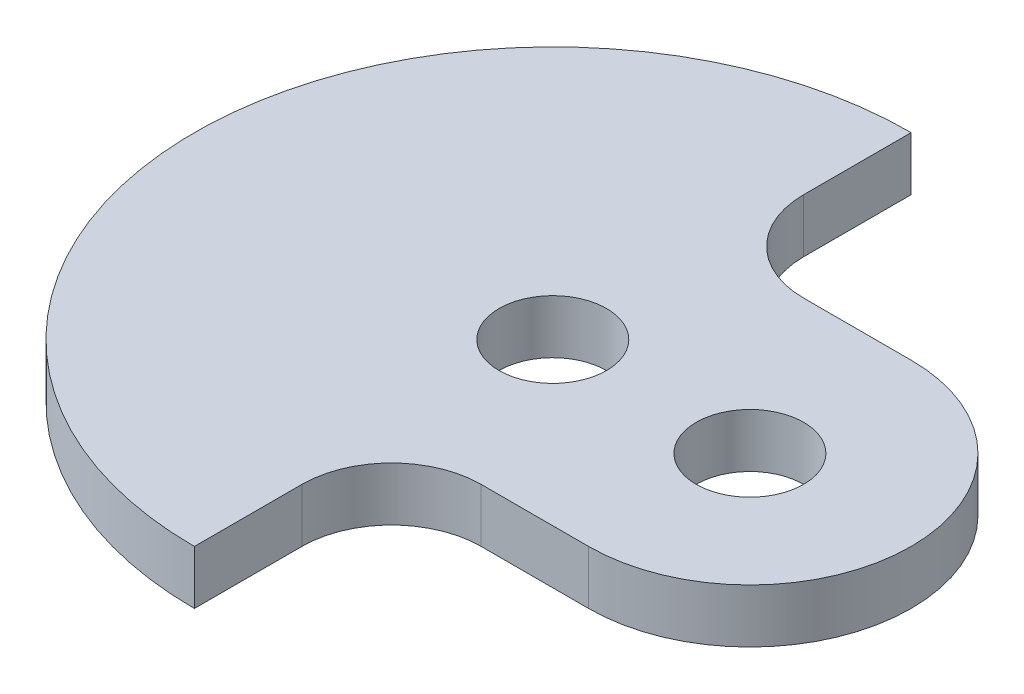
ISO-10303-21;
HEADER;
FILE_DESCRIPTION(('STEP AP214'),'2;1');
FILE_NAME('part.step','',(''),(''),'','','');
FILE_SCHEMA(('AUTOMOTIVE_DESIGN { 1 0 10303 214 1 1 1 1 }'));
ENDSEC;
DATA;
#1=APPLICATION_CONTEXT('core data for automotive mechanical design processes');
#2=APPLICATION_PROTOCOL_DEFINITION('international standard','automotive_design',2000,#1);
#3=PRODUCT_CONTEXT('',#1,'mechanical');
#4=PRODUCT('Part','Part','',(#3));
#5=PRODUCT_RELATED_PRODUCT_CATEGORY('part','',(#4));
#6=PRODUCT_DEFINITION_FORMATION('','',#4);
#7=PRODUCT_DEFINITION_CONTEXT('part definition',#1,'design');
#8=PRODUCT_DEFINITION('design','',#6,#7);
#9=PRODUCT_DEFINITION_SHAPE('','',#8);
#10=(LENGTH_UNIT() NAMED_UNIT(*) SI_UNIT(.MILLI.,.METRE.));
#11=(NAMED_UNIT(*) PLANE_ANGLE_UNIT() SI_UNIT($,.RADIAN.));
#12=(NAMED_UNIT(*) SI_UNIT($,.STERADIAN.) SOLID_ANGLE_UNIT());
#13=UNCERTAINTY_MEASURE_WITH_UNIT(LENGTH_MEASURE(1.E-05),#10,'distance_accuracy_value','');
#14=(GEOMETRIC_REPRESENTATION_CONTEXT(3) GLOBAL_UNCERTAINTY_ASSIGNED_CONTEXT((#13)) GLOBAL_UNIT_ASSIGNED_CONTEXT((#10,
#11,#12)) REPRESENTATION_CONTEXT('',''));
#15=CARTESIAN_POINT('',(0.,0.,0.));
#16=DIRECTION('',(0.,0.,1.));
#17=DIRECTION('',(1.,0.,0.));
#18=AXIS2_PLACEMENT_3D('',#15,#16,#17);
#19=CARTESIAN_POINT('',(45.6667674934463,3.,0.));
#20=DIRECTION('',(0.,1.,0.));
#21=DIRECTION('',(0.,0.,1.));
#22=AXIS2_PLACEMENT_3D('',#19,#20,#21);
#23=PLANE('',#22);
#24=CARTESIAN_POINT('',(34.6667674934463,3.,0.));
#25=DIRECTION('',(0.,1.,0.));
#26=DIRECTION('',(0.,0.,1.));
#27=AXIS2_PLACEMENT_3D('',#24,#25,#26);
#28=CIRCLE('',#27,3.);
#29=CARTESIAN_POINT('',(34.6667674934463,3.,3.));
#30=VERTEX_POINT('',#29);
#31=EDGE_CURVE('E116',#30,#30,#28,.T.);
#32=ORIENTED_EDGE('',*,*,#31,.F.);
#33=EDGE_LOOP('',(#32));
#34=FACE_BOUND('',#33,.T.);
#35=CARTESIAN_POINT('',(45.6667674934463,3.,0.));
#36=DIRECTION('',(0.,1.,0.));
#37=DIRECTION('',(0.,0.,1.));
#38=AXIS2_PLACEMENT_3D('',#35,#36,#37);
#39=CIRCLE('',#38,9.);
#40=CARTESIAN_POINT('',(45.6667674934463,3.,9.));
#41=VERTEX_POINT('',#40);
#42=CARTESIAN_POINT('',(45.6667674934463,3.,-9.));
#43=VERTEX_POINT('',#42);
#44=EDGE_CURVE('E134',#41,#43,#39,.T.);
#45=ORIENTED_EDGE('',*,*,#44,.T.);
#46=DIRECTION('',(-1.,0.,0.));
#47=VECTOR('',#46,1.);
#48=CARTESIAN_POINT('',(39.6667674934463,3.,-9.));
#49=LINE('',#48,#47);
#50=CARTESIAN_POINT('',(39.6667674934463,3.,-9.));
#51=VERTEX_POINT('',#50);
#52=EDGE_CURVE('E111',#43,#51,#49,.T.);
#53=ORIENTED_EDGE('',*,*,#52,.T.);
#54=CARTESIAN_POINT('',(39.6667674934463,3.,-14.));
#55=DIRECTION('',(0.,-1.,0.));
#56=DIRECTION('',(0.,0.,-1.));
#57=AXIS2_PLACEMENT_3D('',#54,#55,#56);
#58=CIRCLE('',#57,5.);
#59=CARTESIAN_POINT('',(34.6667674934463,3.,-14.));
#60=VERTEX_POINT('',#59);
#61=EDGE_CURVE('E137',#51,#60,#58,.T.);
#62=ORIENTED_EDGE('',*,*,#61,.T.);
#63=DIRECTION('',(0.,0.,-1.));
#64=VECTOR('',#63,1.);
#65=CARTESIAN_POINT('',(34.6667674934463,3.,-14.));
#66=LINE('',#65,#64);
#67=CARTESIAN_POINT('',(34.6667674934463,3.,-20.));
#68=VERTEX_POINT('',#67);
#69=EDGE_CURVE('E139',#60,#68,#66,.T.);
#70=ORIENTED_EDGE('',*,*,#69,.T.);
#71=CARTESIAN_POINT('',(34.6667674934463,3.,0.));
#72=DIRECTION('',(0.,1.,0.));
#73=DIRECTION('',(0.,0.,1.));
#74=AXIS2_PLACEMENT_3D('',#71,#72,#73);
#75=CIRCLE('',#74,20.);
#76=CARTESIAN_POINT('',(34.6667674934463,3.,20.));
#77=VERTEX_POINT('',#76);
#78=EDGE_CURVE('E141',#68,#77,#75,.T.);
#79=ORIENTED_EDGE('',*,*,#78,.T.);
#80=DIRECTION('',(0.,0.,-1.));
#81=VECTOR('',#80,1.);
#82=CARTESIAN_POINT('',(34.6667674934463,3.,20.));
#83=LINE('',#82,#81);
#84=CARTESIAN_POINT('',(34.6667674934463,3.,14.));
#85=VERTEX_POINT('',#84);
#86=EDGE_CURVE('E143',#77,#85,#83,.T.);
#87=ORIENTED_EDGE('',*,*,#86,.T.);
#88=CARTESIAN_POINT('',(39.6667674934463,3.,14.));
#89=DIRECTION('',(0.,-1.,0.));
#90=DIRECTION('',(0.,0.,-1.));
#91=AXIS2_PLACEMENT_3D('',#88,#89,#90);
#92=CIRCLE('',#91,5.);
#93=CARTESIAN_POINT('',(39.6667674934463,3.,9.));
#94=VERTEX_POINT('',#93);
#95=EDGE_CURVE('E52',#85,#94,#92,.T.);
#96=ORIENTED_EDGE('',*,*,#95,.T.);
#97=DIRECTION('',(1.,0.,0.));
#98=VECTOR('',#97,1.);
#99=CARTESIAN_POINT('',(39.6667674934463,3.,9.));
#100=LINE('',#99,#98);
#101=EDGE_CURVE('E47',#94,#41,#100,.T.);
#102=ORIENTED_EDGE('',*,*,#101,.T.);
#103=EDGE_LOOP('',(#45,#53,#62,#70,#79,#87,#96,#102));
#104=FACE_BOUND('',#103,.T.);
#105=CARTESIAN_POINT('',(45.6667674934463,3.,0.));
#106=DIRECTION('',(0.,1.,0.));
#107=DIRECTION('',(0.,0.,1.));
#108=AXIS2_PLACEMENT_3D('',#105,#106,#107);
#109=CIRCLE('',#108,3.);
#110=CARTESIAN_POINT('',(45.6667674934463,3.,3.));
#111=VERTEX_POINT('',#110);
#112=EDGE_CURVE('E214',#111,#111,#109,.T.);
#113=ORIENTED_EDGE('',*,*,#112,.F.);
#114=EDGE_LOOP('',(#113));
#115=FACE_BOUND('',#114,.T.);
#116=ADVANCED_FACE('F32',(#34,#104,#115),#23,.T.);
#117=CARTESIAN_POINT('',(45.6667674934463,0.,0.));
#118=DIRECTION('',(0.,1.,0.));
#119=DIRECTION('',(0.,0.,1.));
#120=AXIS2_PLACEMENT_3D('',#117,#118,#119);
#121=PLANE('',#120);
#122=CARTESIAN_POINT('',(34.6667674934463,0.,0.));
#123=DIRECTION('',(0.,1.,0.));
#124=DIRECTION('',(0.,0.,1.));
#125=AXIS2_PLACEMENT_3D('',#122,#123,#124);
#126=CIRCLE('',#125,3.);
#127=CARTESIAN_POINT('',(34.6667674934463,0.,3.));
#128=VERTEX_POINT('',#127);
#129=EDGE_CURVE('E119',#128,#128,#126,.T.);
#130=ORIENTED_EDGE('',*,*,#129,.T.);
#131=EDGE_LOOP('',(#130));
#132=FACE_BOUND('',#131,.T.);
#133=CARTESIAN_POINT('',(45.6667674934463,0.,0.));
#134=DIRECTION('',(0.,1.,0.));
#135=DIRECTION('',(0.,0.,1.));
#136=AXIS2_PLACEMENT_3D('',#133,#134,#135);
#137=CIRCLE('',#136,9.);
#138=CARTESIAN_POINT('',(45.6667674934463,0.,9.));
#139=VERTEX_POINT('',#138);
#140=CARTESIAN_POINT('',(45.6667674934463,0.,-9.));
#141=VERTEX_POINT('',#140);
#142=EDGE_CURVE('E102',#139,#141,#137,.T.);
#143=ORIENTED_EDGE('',*,*,#142,.F.);
#144=DIRECTION('',(1.,0.,0.));
#145=VECTOR('',#144,1.);
#146=CARTESIAN_POINT('',(39.6667674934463,0.,9.));
#147=LINE('',#146,#145);
#148=CARTESIAN_POINT('',(39.6667674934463,0.,9.));
#149=VERTEX_POINT('',#148);
#150=EDGE_CURVE('E132',#149,#139,#147,.T.);
#151=ORIENTED_EDGE('',*,*,#150,.F.);
#152=CARTESIAN_POINT('',(39.6667674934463,0.,14.));
#153=DIRECTION('',(0.,-1.,0.));
#154=DIRECTION('',(0.,0.,-1.));
#155=AXIS2_PLACEMENT_3D('',#152,#153,#154);
#156=CIRCLE('',#155,5.);
#157=CARTESIAN_POINT('',(34.6667674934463,0.,14.));
#158=VERTEX_POINT('',#157);
#159=EDGE_CURVE('E130',#158,#149,#156,.T.);
#160=ORIENTED_EDGE('',*,*,#159,.F.);
#161=DIRECTION('',(0.,0.,-1.));
#162=VECTOR('',#161,1.);
#163=CARTESIAN_POINT('',(34.6667674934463,0.,20.));
#164=LINE('',#163,#162);
#165=CARTESIAN_POINT('',(34.6667674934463,0.,20.));
#166=VERTEX_POINT('',#165);
#167=EDGE_CURVE('E128',#166,#158,#164,.T.);
#168=ORIENTED_EDGE('',*,*,#167,.F.);
#169=CARTESIAN_POINT('',(34.6667674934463,0.,0.));
#170=DIRECTION('',(0.,1.,0.));
#171=DIRECTION('',(0.,0.,1.));
#172=AXIS2_PLACEMENT_3D('',#169,#170,#171);
#173=CIRCLE('',#172,20.);
#174=CARTESIAN_POINT('',(34.6667674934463,0.,-20.));
#175=VERTEX_POINT('',#174);
#176=EDGE_CURVE('E126',#175,#166,#173,.T.);
#177=ORIENTED_EDGE('',*,*,#176,.F.);
#178=DIRECTION('',(0.,0.,-1.));
#179=VECTOR('',#178,1.);
#180=CARTESIAN_POINT('',(34.6667674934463,0.,-14.));
#181=LINE('',#180,#179);
#182=CARTESIAN_POINT('',(34.6667674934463,0.,-14.));
#183=VERTEX_POINT('',#182);
#184=EDGE_CURVE('E124',#183,#175,#181,.T.);
#185=ORIENTED_EDGE('',*,*,#184,.F.);
#186=CARTESIAN_POINT('',(39.6667674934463,0.,-14.));
#187=DIRECTION('',(0.,-1.,0.));
#188=DIRECTION('',(0.,0.,-1.));
#189=AXIS2_PLACEMENT_3D('',#186,#187,#188);
#190=CIRCLE('',#189,5.);
#191=CARTESIAN_POINT('',(39.6667674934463,0.,-9.));
#192=VERTEX_POINT('',#191);
#193=EDGE_CURVE('E104',#192,#183,#190,.T.);
#194=ORIENTED_EDGE('',*,*,#193,.F.);
#195=DIRECTION('',(-1.,0.,0.));
#196=VECTOR('',#195,1.);
#197=CARTESIAN_POINT('',(39.6667674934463,0.,-9.));
#198=LINE('',#197,#196);
#199=EDGE_CURVE('E97',#141,#192,#198,.T.);
#200=ORIENTED_EDGE('',*,*,#199,.F.);
#201=EDGE_LOOP('',(#143,#151,#160,#168,#177,#185,#194,#200));
#202=FACE_BOUND('',#201,.T.);
#203=CARTESIAN_POINT('',(45.6667674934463,0.,0.));
#204=DIRECTION('',(0.,1.,0.));
#205=DIRECTION('',(0.,0.,1.));
#206=AXIS2_PLACEMENT_3D('',#203,#204,#205);
#207=CIRCLE('',#206,3.);
#208=CARTESIAN_POINT('',(45.6667674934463,0.,3.));
#209=VERTEX_POINT('',#208);
#210=EDGE_CURVE('E217',#209,#209,#207,.T.);
#211=ORIENTED_EDGE('',*,*,#210,.T.);
#212=EDGE_LOOP('',(#211));
#213=FACE_BOUND('',#212,.T.);
#214=ADVANCED_FACE('F98',(#132,#202,#213),#121,.F.);
#215=CARTESIAN_POINT('',(45.6667674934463,3.,0.));
#216=DIRECTION('',(0.,-1.,0.));
#217=DIRECTION('',(0.,0.,-1.));
#218=AXIS2_PLACEMENT_3D('',#215,#216,#217);
#219=CYLINDRICAL_SURFACE('',#218,9.);
#220=ORIENTED_EDGE('',*,*,#142,.T.);
#221=DIRECTION('',(0.,-1.,0.));
#222=VECTOR('',#221,1.);
#223=CARTESIAN_POINT('',(45.6667674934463,3.,-9.));
#224=LINE('',#223,#222);
#225=EDGE_CURVE('E11',#43,#141,#224,.T.);
#226=ORIENTED_EDGE('',*,*,#225,.F.);
#227=ORIENTED_EDGE('',*,*,#44,.F.);
#228=DIRECTION('',(0.,-1.,0.));
#229=VECTOR('',#228,1.);
#230=CARTESIAN_POINT('',(45.6667674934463,3.,9.));
#231=LINE('',#230,#229);
#232=EDGE_CURVE('E115',#41,#139,#231,.T.);
#233=ORIENTED_EDGE('',*,*,#232,.T.);
#234=EDGE_LOOP('',(#220,#226,#227,#233));
#235=FACE_BOUND('',#234,.T.);
#236=ADVANCED_FACE('F34',(#235),#219,.T.);
#237=CARTESIAN_POINT('',(39.6667674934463,3.,-9.));
#238=DIRECTION('',(0.,0.,1.));
#239=DIRECTION('',(1.,0.,0.));
#240=AXIS2_PLACEMENT_3D('',#237,#238,#239);
#241=PLANE('',#240);
#242=ORIENTED_EDGE('',*,*,#199,.T.);
#243=DIRECTION('',(0.,-1.,0.));
#244=VECTOR('',#243,1.);
#245=CARTESIAN_POINT('',(39.6667674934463,3.,-9.));
#246=LINE('',#245,#244);
#247=EDGE_CURVE('E40',#51,#192,#246,.T.);
#248=ORIENTED_EDGE('',*,*,#247,.F.);
#249=ORIENTED_EDGE('',*,*,#52,.F.);
#250=ORIENTED_EDGE('',*,*,#225,.T.);
#251=EDGE_LOOP('',(#242,#248,#249,#250));
#252=FACE_BOUND('',#251,.T.);
#253=ADVANCED_FACE('F110',(#252),#241,.F.);
#254=CARTESIAN_POINT('',(39.6667674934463,3.,-14.));
#255=DIRECTION('',(0.,-1.,0.));
#256=DIRECTION('',(0.,0.,-1.));
#257=AXIS2_PLACEMENT_3D('',#254,#255,#256);
#258=CYLINDRICAL_SURFACE('',#257,5.);
#259=ORIENTED_EDGE('',*,*,#193,.T.);
#260=DIRECTION('',(0.,-1.,0.));
#261=VECTOR('',#260,1.);
#262=CARTESIAN_POINT('',(34.6667674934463,3.,-14.));
#263=LINE('',#262,#261);
#264=EDGE_CURVE('E160',#60,#183,#263,.T.);
#265=ORIENTED_EDGE('',*,*,#264,.F.);
#266=ORIENTED_EDGE('',*,*,#61,.F.);
#267=ORIENTED_EDGE('',*,*,#247,.T.);
#268=EDGE_LOOP('',(#259,#265,#266,#267));
#269=FACE_BOUND('',#268,.T.);
#270=ADVANCED_FACE('F164',(#269),#258,.F.);
#271=CARTESIAN_POINT('',(34.6667674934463,3.,-14.));
#272=DIRECTION('',(-1.,0.,0.));
#273=DIRECTION('',(0.,0.,1.));
#274=AXIS2_PLACEMENT_3D('',#271,#272,#273);
#275=PLANE('',#274);
#276=ORIENTED_EDGE('',*,*,#184,.T.);
#277=DIRECTION('',(0.,-1.,0.));
#278=VECTOR('',#277,1.);
#279=CARTESIAN_POINT('',(34.6667674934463,3.,-20.));
#280=LINE('',#279,#278);
#281=EDGE_CURVE('E157',#68,#175,#280,.T.);
#282=ORIENTED_EDGE('',*,*,#281,.F.);
#283=ORIENTED_EDGE('',*,*,#69,.F.);
#284=ORIENTED_EDGE('',*,*,#264,.T.);
#285=EDGE_LOOP('',(#276,#282,#283,#284));
#286=FACE_BOUND('',#285,.T.);
#287=ADVANCED_FACE('F172',(#286),#275,.F.);
#288=CARTESIAN_POINT('',(34.6667674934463,3.,0.));
#289=DIRECTION('',(0.,-1.,0.));
#290=DIRECTION('',(0.,0.,-1.));
#291=AXIS2_PLACEMENT_3D('',#288,#289,#290);
#292=CYLINDRICAL_SURFACE('',#291,20.);
#293=ORIENTED_EDGE('',*,*,#176,.T.);
#294=DIRECTION('',(0.,-1.,0.));
#295=VECTOR('',#294,1.);
#296=CARTESIAN_POINT('',(34.6667674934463,3.,20.));
#297=LINE('',#296,#295);
#298=EDGE_CURVE('E154',#77,#166,#297,.T.);
#299=ORIENTED_EDGE('',*,*,#298,.F.);
#300=ORIENTED_EDGE('',*,*,#78,.F.);
#301=ORIENTED_EDGE('',*,*,#281,.T.);
#302=EDGE_LOOP('',(#293,#299,#300,#301));
#303=FACE_BOUND('',#302,.T.);
#304=ADVANCED_FACE('F175',(#303),#292,.T.);
#305=CARTESIAN_POINT('',(34.6667674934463,3.,20.));
#306=DIRECTION('',(-1.,0.,0.));
#307=DIRECTION('',(0.,0.,1.));
#308=AXIS2_PLACEMENT_3D('',#305,#306,#307);
#309=PLANE('',#308);
#310=ORIENTED_EDGE('',*,*,#167,.T.);
#311=DIRECTION('',(0.,-1.,0.));
#312=VECTOR('',#311,1.);
#313=CARTESIAN_POINT('',(34.6667674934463,3.,14.));
#314=LINE('',#313,#312);
#315=EDGE_CURVE('E151',#85,#158,#314,.T.);
#316=ORIENTED_EDGE('',*,*,#315,.F.);
#317=ORIENTED_EDGE('',*,*,#86,.F.);
#318=ORIENTED_EDGE('',*,*,#298,.T.);
#319=EDGE_LOOP('',(#310,#316,#317,#318));
#320=FACE_BOUND('',#319,.T.);
#321=ADVANCED_FACE('F180',(#320),#309,.F.);
#322=CARTESIAN_POINT('',(39.6667674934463,3.,14.));
#323=DIRECTION('',(0.,-1.,0.));
#324=DIRECTION('',(0.,0.,-1.));
#325=AXIS2_PLACEMENT_3D('',#322,#323,#324);
#326=CYLINDRICAL_SURFACE('',#325,5.);
#327=ORIENTED_EDGE('',*,*,#159,.T.);
#328=DIRECTION('',(0.,-1.,0.));
#329=VECTOR('',#328,1.);
#330=CARTESIAN_POINT('',(39.6667674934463,3.,9.));
#331=LINE('',#330,#329);
#332=EDGE_CURVE('E148',#94,#149,#331,.T.);
#333=ORIENTED_EDGE('',*,*,#332,.F.);
#334=ORIENTED_EDGE('',*,*,#95,.F.);
#335=ORIENTED_EDGE('',*,*,#315,.T.);
#336=EDGE_LOOP('',(#327,#333,#334,#335));
#337=FACE_BOUND('',#336,.T.);
#338=ADVANCED_FACE('F183',(#337),#326,.F.);
#339=CARTESIAN_POINT('',(39.6667674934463,3.,9.));
#340=DIRECTION('',(0.,0.,-1.));
#341=DIRECTION('',(-1.,0.,0.));
#342=AXIS2_PLACEMENT_3D('',#339,#340,#341);
#343=PLANE('',#342);
#344=ORIENTED_EDGE('',*,*,#150,.T.);
#345=ORIENTED_EDGE('',*,*,#232,.F.);
#346=ORIENTED_EDGE('',*,*,#101,.F.);
#347=ORIENTED_EDGE('',*,*,#332,.T.);
#348=EDGE_LOOP('',(#344,#345,#346,#347));
#349=FACE_BOUND('',#348,.T.);
#350=ADVANCED_FACE('F185',(#349),#343,.F.);
#351=CARTESIAN_POINT('',(34.6667674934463,3.,0.));
#352=DIRECTION('',(0.,-1.,0.));
#353=DIRECTION('',(0.,0.,-1.));
#354=AXIS2_PLACEMENT_3D('',#351,#352,#353);
#355=CYLINDRICAL_SURFACE('',#354,3.);
#356=ORIENTED_EDGE('',*,*,#31,.T.);
#357=EDGE_LOOP('',(#356));
#358=FACE_BOUND('',#357,.T.);
#359=ORIENTED_EDGE('',*,*,#129,.F.);
#360=EDGE_LOOP('',(#359));
#361=FACE_BOUND('',#360,.T.);
#362=ADVANCED_FACE('F187',(#358,#361),#355,.F.);
#363=CARTESIAN_POINT('',(45.6667674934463,3.,0.));
#364=DIRECTION('',(0.,-1.,0.));
#365=DIRECTION('',(0.,0.,-1.));
#366=AXIS2_PLACEMENT_3D('',#363,#364,#365);
#367=CYLINDRICAL_SURFACE('',#366,3.);
#368=ORIENTED_EDGE('',*,*,#112,.T.);
#369=EDGE_LOOP('',(#368));
#370=FACE_BOUND('',#369,.T.);
#371=ORIENTED_EDGE('',*,*,#210,.F.);
#372=EDGE_LOOP('',(#371));
#373=FACE_BOUND('',#372,.T.);
#374=ADVANCED_FACE('F193',(#370,#373),#367,.F.);
#375=CLOSED_SHELL('',(#116,#214,#236,#253,#270,#287,#304,#321,#338,#350,#362,#374));
#376=MANIFOLD_SOLID_BREP('B2',#375);
#377=ADVANCED_BREP_SHAPE_REPRESENTATION('',(#18,#376),#14);
#378=SHAPE_DEFINITION_REPRESENTATION(#9,#377);
ENDSEC;
END-ISO-10303-21;
